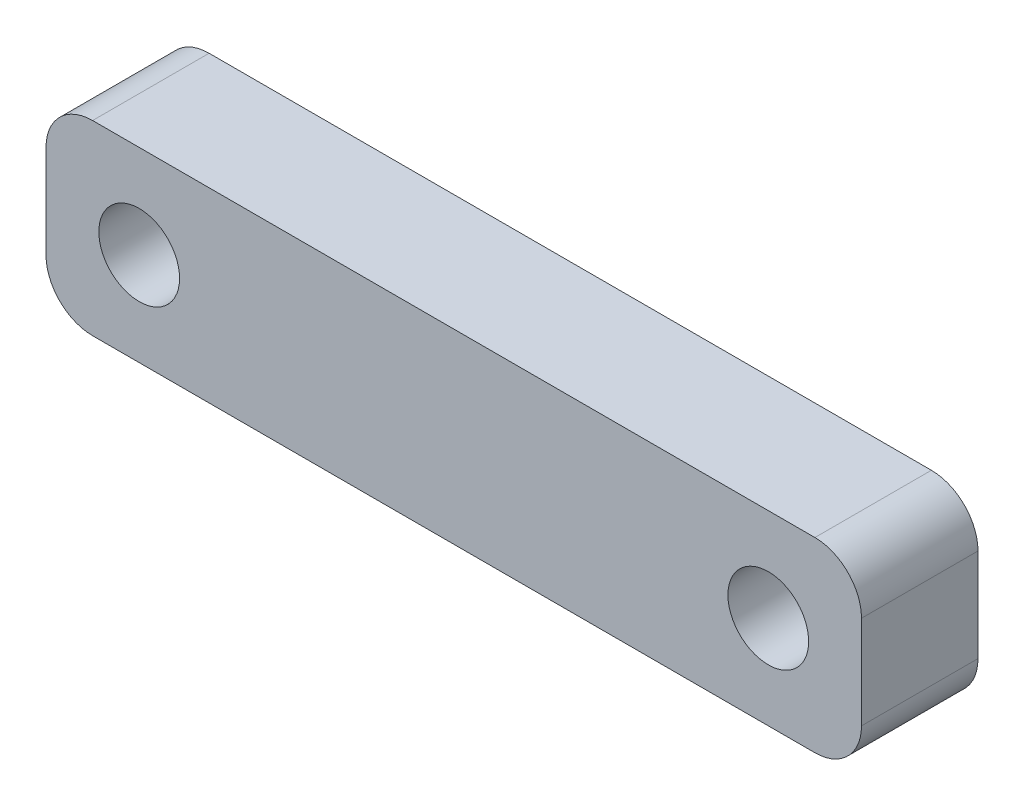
from build123d import *

# Parameters (mm, degrees)
SKETCH1_W           = 44.45
SKETCH1_H           = 10.16
SKETCH1_R           = 2.2
BOSS_EXTRUDE1_DEPTH = 6.35
FILLET1_R           = 2.54


with BuildPart() as part:
    # Sketch1 → Boss-Extrude1 (new body)
    with BuildSketch(Plane.XY):
        with Locations((-156.002511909, -22.736276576)):
            Rectangle(SKETCH1_W, SKETCH1_H)
        with Locations((-173.147511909, -22.736276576)):
            Circle(SKETCH1_R, mode=Mode.SUBTRACT)
        with Locations(Location((-138.857511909, -22.736276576, 0), (0, 0, 180))):
            Circle(SKETCH1_R, mode=Mode.SUBTRACT)
    extrude(amount=BOSS_EXTRUDE1_DEPTH)

    # Fillet1
    fillet1_edges = [part.edges().sort_by_distance(p)[0] for p in [
        (-178.227511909, -17.656276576, 3.175),
        (-133.777511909, -17.656276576, 3.175),
        (-133.777511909, -27.816276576, 3.175),
        (-178.227511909, -27.816276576, 3.175),
    ]]
    fillet(fillet1_edges, radius=FILLET1_R)


solid = part.part
